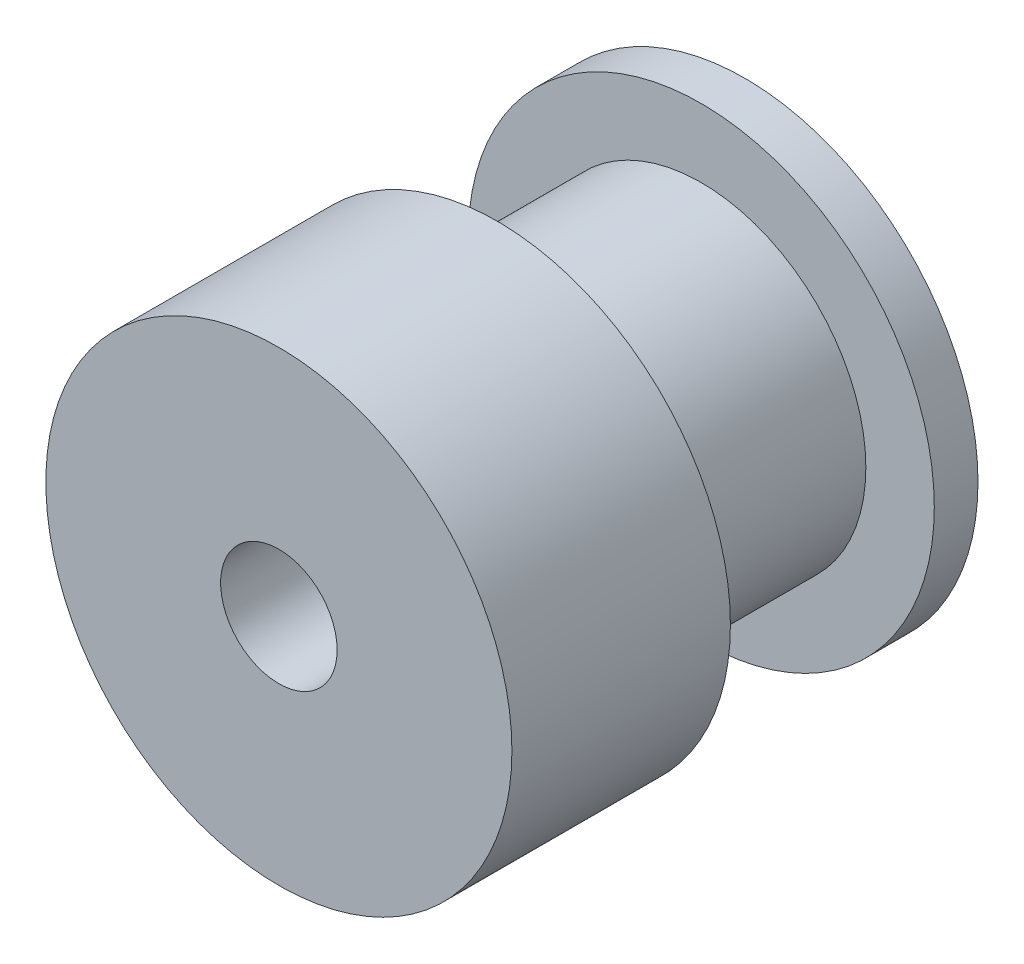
from build123d import *

# Parameters (mm, degrees)
CROQUIS1_R              = 8
CROQUIS1_R_2            = 2
SALIENTE_EXTRUIR1_DEPTH = 1.5
CROQUIS2_R              = 5.65
CROQUIS2_R_2            = 2
SALIENTE_EXTRUIR2_DEPTH = 7
CROQUIS3_R              = 8
CROQUIS3_R_2            = 2
SALIENTE_EXTRUIR3_DEPTH = 7.5


with BuildPart() as part:
    # Croquis1 → Saliente-Extruir1 (new body)
    with BuildSketch(Plane.XY):
        Circle(CROQUIS1_R)
        Circle(CROQUIS1_R_2, mode=Mode.SUBTRACT)
    extrude(amount=SALIENTE_EXTRUIR1_DEPTH)

    # Croquis2 → Saliente-Extruir2 (add)
    with BuildSketch(Plane.XY.offset(1.5)):
        Circle(CROQUIS2_R)
        Circle(CROQUIS2_R_2, mode=Mode.SUBTRACT)
    extrude(amount=SALIENTE_EXTRUIR2_DEPTH)

    # Croquis3 → Saliente-Extruir3 (add)
    with BuildSketch(Plane.XY.offset(8.5)):
        Circle(CROQUIS3_R)
        Circle(CROQUIS3_R_2, mode=Mode.SUBTRACT)
    extrude(amount=SALIENTE_EXTRUIR3_DEPTH)


solid = part.part
